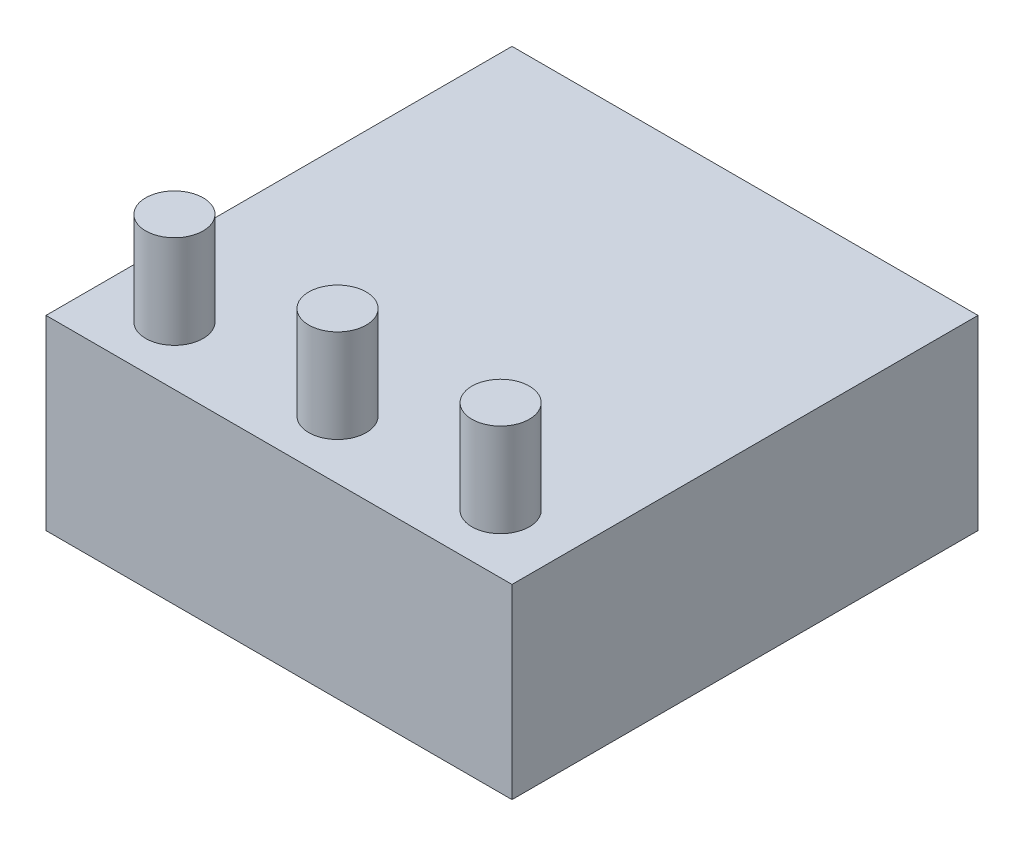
from build123d import *

# Parameters (mm, degrees)
SKETCH2_W      = 50
SKETCH2_H      = 50
EXTRUDE1_DEPTH = 20
SKETCH4_R      = 3.079857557
EXTRUDE3_DEPTH = 10


with BuildPart() as part:
    # Sketch2 → Extrude1 (new body)
    with BuildSketch(Plane(origin=(0, 0, 0), x_dir=(1, 0, 0), z_dir=(0, 1, 0))):
        Rectangle(SKETCH2_W, SKETCH2_H)
    extrude(amount=EXTRUDE1_DEPTH)

    # Sketch4 → Extrude3 (add)
    with BuildSketch(Plane(origin=(0, 20, 0), x_dir=(-1, 0, 0), z_dir=(0, 1, 0))):
        with Locations(Location((-17.5, 18.719759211, 0), (0, 0, 90))):
            Circle(SKETCH4_R)
        with Locations(Location((0, 18.719759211, 0), (0, 0, 90))):
            Circle(SKETCH4_R)
        with Locations(Location((17.5, 18.719759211, 0), (0, 0, 90))):
            Circle(SKETCH4_R)
    extrude(amount=EXTRUDE3_DEPTH)


solid = part.part
